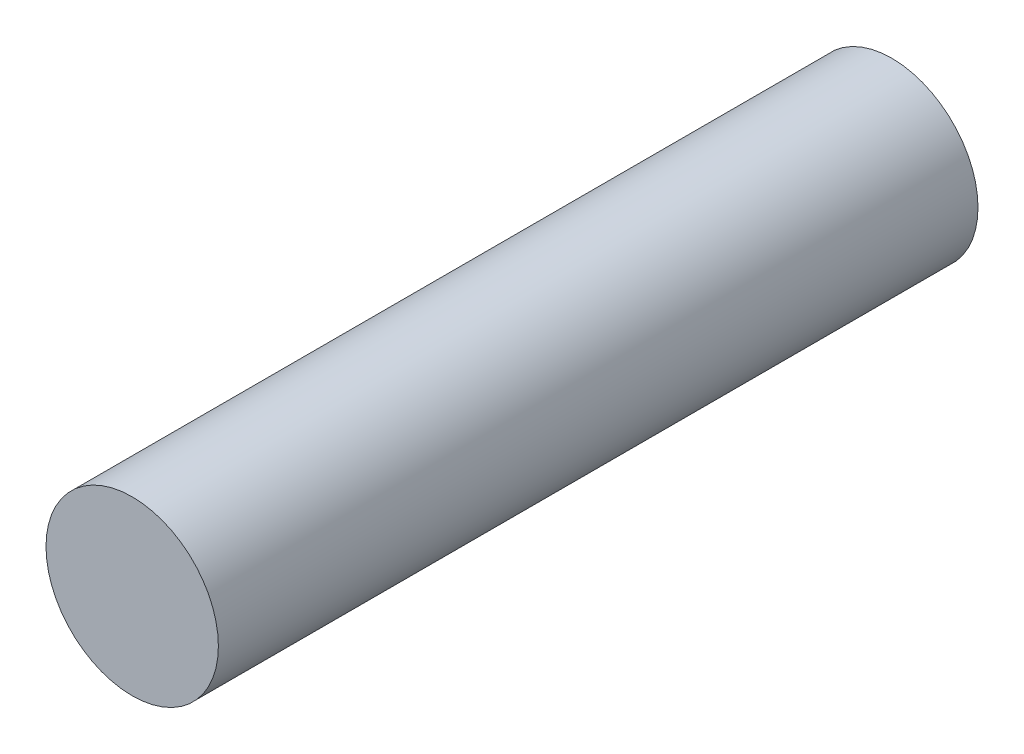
from build123d import *

# Parameters (mm, degrees)
SKETCH1_R           = 2.95
BOSS_EXTRUDE1_DEPTH = 26


with BuildPart() as part:
    # Sketch1 → Boss-Extrude1 (new body)
    with BuildSketch(Plane.XY):
        with Locations(Location((0, 0, 0), (0, 0, 180))):
            Circle(SKETCH1_R)
    extrude(amount=BOSS_EXTRUDE1_DEPTH)


solid = part.part
